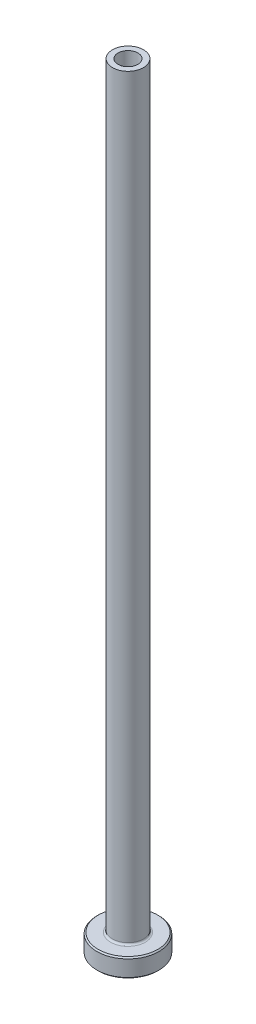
from build123d import *

# Parameters (mm, degrees)
FILLET1_R     = 0.3
CHAMFER1_SIZE = 0.2
CHAMFER3_SIZE = 0.5


with BuildPart() as part:
    # Sketch1 → Revolve1 (revolve)
    with BuildSketch(Plane.XY, mode=Mode.PRIVATE) as revolve1_sk:
        Polygon((-1.6, 125), (-2.5, 125), (-2.5, 3), (-5, 3), (-5, 0), (-1.85, 0), (-1.85, 68), (-1.6, 80), align=None)
    revolve(revolve1_sk.sketch.rotate(Axis((0, 92.187680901, 0), (0, -1, 0)), 270), axis=Axis((0, 92.187680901, 0), (0, -1, 0)))

    # Fillet1
    fillet1_edges = [part.edges().sort_by_distance(p)[0] for p in [
        (0, 3, -2.5),
    ]]
    fillet(fillet1_edges, radius=FILLET1_R)

    # Chamfer1
    chamfer1_edges = [part.edges().sort_by_distance(p)[0] for p in [
        (0, 0, -5),
        (0, 3, -5),
    ]]
    chamfer(chamfer1_edges, length=CHAMFER1_SIZE)

    # Chamfer3
    chamfer3_edges = [part.edges().sort_by_distance(p)[0] for p in [
        (0, 0, -1.85),
    ]]
    chamfer(chamfer3_edges, length=CHAMFER3_SIZE)


solid = part.part
